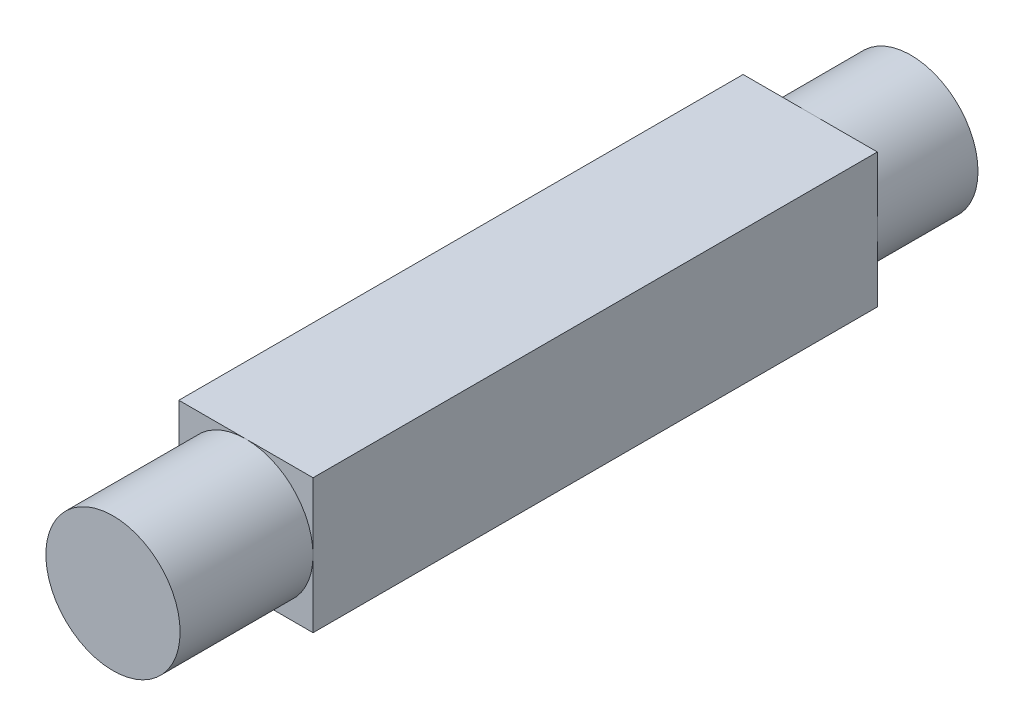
ISO-10303-21;
HEADER;
FILE_DESCRIPTION(('STEP AP214'),'2;1');
FILE_NAME('part.step','',(''),(''),'','','');
FILE_SCHEMA(('AUTOMOTIVE_DESIGN { 1 0 10303 214 1 1 1 1 }'));
ENDSEC;
DATA;
#1=APPLICATION_CONTEXT('core data for automotive mechanical design processes');
#2=APPLICATION_PROTOCOL_DEFINITION('international standard','automotive_design',2000,#1);
#3=PRODUCT_CONTEXT('',#1,'mechanical');
#4=PRODUCT('Part','Part','',(#3));
#5=PRODUCT_RELATED_PRODUCT_CATEGORY('part','',(#4));
#6=PRODUCT_DEFINITION_FORMATION('','',#4);
#7=PRODUCT_DEFINITION_CONTEXT('part definition',#1,'design');
#8=PRODUCT_DEFINITION('design','',#6,#7);
#9=PRODUCT_DEFINITION_SHAPE('','',#8);
#10=(LENGTH_UNIT() NAMED_UNIT(*) SI_UNIT(.MILLI.,.METRE.));
#11=(NAMED_UNIT(*) PLANE_ANGLE_UNIT() SI_UNIT($,.RADIAN.));
#12=(NAMED_UNIT(*) SI_UNIT($,.STERADIAN.) SOLID_ANGLE_UNIT());
#13=UNCERTAINTY_MEASURE_WITH_UNIT(LENGTH_MEASURE(1.E-05),#10,'distance_accuracy_value','');
#14=(GEOMETRIC_REPRESENTATION_CONTEXT(3) GLOBAL_UNCERTAINTY_ASSIGNED_CONTEXT((#13)) GLOBAL_UNIT_ASSIGNED_CONTEXT((#10,
#11,#12)) REPRESENTATION_CONTEXT('',''));
#15=CARTESIAN_POINT('',(0.,0.,0.));
#16=DIRECTION('',(0.,0.,1.));
#17=DIRECTION('',(1.,0.,0.));
#18=AXIS2_PLACEMENT_3D('',#15,#16,#17);
#19=CARTESIAN_POINT('',(0.,0.,84.5566));
#20=DIRECTION('',(0.,0.,-1.));
#21=DIRECTION('',(-1.,0.,0.));
#22=AXIS2_PLACEMENT_3D('',#19,#20,#21);
#23=CYLINDRICAL_SURFACE('',#22,4.7625);
#24=CARTESIAN_POINT('',(0.,0.,47.182786));
#25=DIRECTION('',(0.,0.,1.));
#26=DIRECTION('',(1.,0.,0.));
#27=AXIS2_PLACEMENT_3D('',#24,#25,#26);
#28=CIRCLE('',#27,4.7625);
#29=CARTESIAN_POINT('',(-4.7625,0.,47.182786));
#30=VERTEX_POINT('',#29);
#31=CARTESIAN_POINT('',(0.,-4.7625,47.182786));
#32=VERTEX_POINT('',#31);
#33=EDGE_CURVE('E125',#30,#32,#28,.T.);
#34=ORIENTED_EDGE('',*,*,#33,.T.);
#35=CARTESIAN_POINT('',(4.7625,0.,47.182786));
#36=VERTEX_POINT('',#35);
#37=EDGE_CURVE('E111',#32,#36,#28,.T.);
#38=ORIENTED_EDGE('',*,*,#37,.T.);
#39=CARTESIAN_POINT('',(0.,4.7625,47.182786));
#40=VERTEX_POINT('',#39);
#41=EDGE_CURVE('E123',#36,#40,#28,.T.);
#42=ORIENTED_EDGE('',*,*,#41,.T.);
#43=EDGE_CURVE('E133',#40,#30,#28,.T.);
#44=ORIENTED_EDGE('',*,*,#43,.T.);
#45=EDGE_LOOP('',(#34,#38,#42,#44));
#46=FACE_BOUND('',#45,.T.);
#47=CARTESIAN_POINT('',(0.,0.,56.6166));
#48=DIRECTION('',(0.,0.,1.));
#49=DIRECTION('',(1.,0.,0.));
#50=AXIS2_PLACEMENT_3D('',#47,#48,#49);
#51=CIRCLE('',#50,4.7625);
#52=CARTESIAN_POINT('',(4.7625,0.,56.6166));
#53=VERTEX_POINT('',#52);
#54=EDGE_CURVE('E126',#53,#53,#51,.T.);
#55=ORIENTED_EDGE('',*,*,#54,.F.);
#56=EDGE_LOOP('',(#55));
#57=FACE_BOUND('',#56,.T.);
#58=ADVANCED_FACE('F40',(#46,#57),#23,.T.);
#59=CARTESIAN_POINT('',(4.7625,4.7625,84.5566));
#60=DIRECTION('',(-1.,0.,0.));
#61=DIRECTION('',(0.,-1.,0.));
#62=AXIS2_PLACEMENT_3D('',#59,#60,#61);
#63=PLANE('',#62);
#64=DIRECTION('',(0.,0.,-1.));
#65=VECTOR('',#64,1.);
#66=CARTESIAN_POINT('',(4.7625,4.7625,84.5566));
#67=LINE('',#66,#65);
#68=CARTESIAN_POINT('',(4.7625,4.7625,47.182786));
#69=VERTEX_POINT('',#68);
#70=CARTESIAN_POINT('',(4.7625,4.7625,7.14247999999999));
#71=VERTEX_POINT('',#70);
#72=EDGE_CURVE('E136',#69,#71,#67,.T.);
#73=ORIENTED_EDGE('',*,*,#72,.F.);
#74=DIRECTION('',(0.,-1.,0.));
#75=VECTOR('',#74,1.);
#76=CARTESIAN_POINT('',(4.7625,4.7625,47.182786));
#77=LINE('',#76,#75);
#78=EDGE_CURVE('E116',#69,#36,#77,.T.);
#79=ORIENTED_EDGE('',*,*,#78,.T.);
#80=CARTESIAN_POINT('',(4.7625,-4.7625,47.182786));
#81=VERTEX_POINT('',#80);
#82=EDGE_CURVE('E108',#36,#81,#77,.T.);
#83=ORIENTED_EDGE('',*,*,#82,.T.);
#84=DIRECTION('',(0.,0.,-1.));
#85=VECTOR('',#84,1.);
#86=CARTESIAN_POINT('',(4.7625,-4.7625,84.5566));
#87=LINE('',#86,#85);
#88=CARTESIAN_POINT('',(4.7625,-4.7625,7.14247999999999));
#89=VERTEX_POINT('',#88);
#90=EDGE_CURVE('E159',#81,#89,#87,.T.);
#91=ORIENTED_EDGE('',*,*,#90,.T.);
#92=DIRECTION('',(0.,-1.,0.));
#93=VECTOR('',#92,1.);
#94=CARTESIAN_POINT('',(4.7625,4.7625,7.14247999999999));
#95=LINE('',#94,#93);
#96=CARTESIAN_POINT('',(4.7625,0.,7.14248));
#97=VERTEX_POINT('',#96);
#98=EDGE_CURVE('E150',#97,#89,#95,.T.);
#99=ORIENTED_EDGE('',*,*,#98,.F.);
#100=EDGE_CURVE('E154',#71,#97,#95,.T.);
#101=ORIENTED_EDGE('',*,*,#100,.F.);
#102=EDGE_LOOP('',(#73,#79,#83,#91,#99,#101));
#103=FACE_BOUND('',#102,.T.);
#104=ADVANCED_FACE('F42',(#103),#63,.F.);
#105=CARTESIAN_POINT('',(-4.7625,4.7625,84.5566));
#106=DIRECTION('',(0.,-1.,0.));
#107=DIRECTION('',(0.,0.,-1.));
#108=AXIS2_PLACEMENT_3D('',#105,#106,#107);
#109=PLANE('',#108);
#110=DIRECTION('',(0.,0.,-1.));
#111=VECTOR('',#110,1.);
#112=CARTESIAN_POINT('',(-4.7625,4.7625,84.5566));
#113=LINE('',#112,#111);
#114=CARTESIAN_POINT('',(-4.7625,4.7625,47.182786));
#115=VERTEX_POINT('',#114);
#116=CARTESIAN_POINT('',(-4.7625,4.7625,7.14247999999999));
#117=VERTEX_POINT('',#116);
#118=EDGE_CURVE('E163',#115,#117,#113,.T.);
#119=ORIENTED_EDGE('',*,*,#118,.F.);
#120=DIRECTION('',(1.,0.,0.));
#121=VECTOR('',#120,1.);
#122=CARTESIAN_POINT('',(-4.7625,4.7625,47.182786));
#123=LINE('',#122,#121);
#124=EDGE_CURVE('E142',#115,#40,#123,.T.);
#125=ORIENTED_EDGE('',*,*,#124,.T.);
#126=EDGE_CURVE('E131',#40,#69,#123,.T.);
#127=ORIENTED_EDGE('',*,*,#126,.T.);
#128=ORIENTED_EDGE('',*,*,#72,.T.);
#129=DIRECTION('',(1.,0.,0.));
#130=VECTOR('',#129,1.);
#131=CARTESIAN_POINT('',(-4.7625,4.7625,7.14247999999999));
#132=LINE('',#131,#130);
#133=CARTESIAN_POINT('',(0.,4.7625,7.14248));
#134=VERTEX_POINT('',#133);
#135=EDGE_CURVE('E155',#134,#71,#132,.T.);
#136=ORIENTED_EDGE('',*,*,#135,.F.);
#137=EDGE_CURVE('E158',#117,#134,#132,.T.);
#138=ORIENTED_EDGE('',*,*,#137,.F.);
#139=EDGE_LOOP('',(#119,#125,#127,#128,#136,#138));
#140=FACE_BOUND('',#139,.T.);
#141=ADVANCED_FACE('F210',(#140),#109,.F.);
#142=CARTESIAN_POINT('',(-4.7625,4.7625,84.5566));
#143=DIRECTION('',(1.,0.,0.));
#144=DIRECTION('',(0.,1.,0.));
#145=AXIS2_PLACEMENT_3D('',#142,#143,#144);
#146=PLANE('',#145);
#147=DIRECTION('',(0.,0.,-1.));
#148=VECTOR('',#147,1.);
#149=CARTESIAN_POINT('',(-4.7625,-4.7625,84.5566));
#150=LINE('',#149,#148);
#151=CARTESIAN_POINT('',(-4.7625,-4.7625,47.182786));
#152=VERTEX_POINT('',#151);
#153=CARTESIAN_POINT('',(-4.7625,-4.7625,7.14247999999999));
#154=VERTEX_POINT('',#153);
#155=EDGE_CURVE('E161',#152,#154,#150,.T.);
#156=ORIENTED_EDGE('',*,*,#155,.F.);
#157=DIRECTION('',(0.,1.,0.));
#158=VECTOR('',#157,1.);
#159=CARTESIAN_POINT('',(-4.7625,4.7625,47.182786));
#160=LINE('',#159,#158);
#161=EDGE_CURVE('E55',#152,#30,#160,.T.);
#162=ORIENTED_EDGE('',*,*,#161,.T.);
#163=EDGE_CURVE('E137',#30,#115,#160,.T.);
#164=ORIENTED_EDGE('',*,*,#163,.T.);
#165=ORIENTED_EDGE('',*,*,#118,.T.);
#166=DIRECTION('',(0.,1.,0.));
#167=VECTOR('',#166,1.);
#168=CARTESIAN_POINT('',(-4.7625,4.7625,7.14247999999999));
#169=LINE('',#168,#167);
#170=CARTESIAN_POINT('',(-4.7625,0.,7.14248));
#171=VERTEX_POINT('',#170);
#172=EDGE_CURVE('E151',#171,#117,#169,.T.);
#173=ORIENTED_EDGE('',*,*,#172,.F.);
#174=EDGE_CURVE('E146',#154,#171,#169,.T.);
#175=ORIENTED_EDGE('',*,*,#174,.F.);
#176=EDGE_LOOP('',(#156,#162,#164,#165,#173,#175));
#177=FACE_BOUND('',#176,.T.);
#178=ADVANCED_FACE('F181',(#177),#146,.F.);
#179=CARTESIAN_POINT('',(-4.7625,-4.7625,84.5566));
#180=DIRECTION('',(0.,1.,0.));
#181=DIRECTION('',(0.,0.,1.));
#182=AXIS2_PLACEMENT_3D('',#179,#180,#181);
#183=PLANE('',#182);
#184=ORIENTED_EDGE('',*,*,#90,.F.);
#185=DIRECTION('',(-1.,0.,0.));
#186=VECTOR('',#185,1.);
#187=CARTESIAN_POINT('',(-4.7625,-4.7625,47.182786));
#188=LINE('',#187,#186);
#189=EDGE_CURVE('E12',#81,#32,#188,.T.);
#190=ORIENTED_EDGE('',*,*,#189,.T.);
#191=EDGE_CURVE('E44',#32,#152,#188,.T.);
#192=ORIENTED_EDGE('',*,*,#191,.T.);
#193=ORIENTED_EDGE('',*,*,#155,.T.);
#194=DIRECTION('',(-1.,0.,0.));
#195=VECTOR('',#194,1.);
#196=CARTESIAN_POINT('',(-4.7625,-4.7625,7.14247999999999));
#197=LINE('',#196,#195);
#198=CARTESIAN_POINT('',(0.,-4.7625,7.14248));
#199=VERTEX_POINT('',#198);
#200=EDGE_CURVE('E168',#199,#154,#197,.T.);
#201=ORIENTED_EDGE('',*,*,#200,.F.);
#202=EDGE_CURVE('E170',#89,#199,#197,.T.);
#203=ORIENTED_EDGE('',*,*,#202,.F.);
#204=EDGE_LOOP('',(#184,#190,#192,#193,#201,#203));
#205=FACE_BOUND('',#204,.T.);
#206=ADVANCED_FACE('F179',(#205),#183,.F.);
#207=CARTESIAN_POINT('',(0.,0.,7.14248));
#208=DIRECTION('',(0.,0.,-1.));
#209=DIRECTION('',(-1.,0.,0.));
#210=AXIS2_PLACEMENT_3D('',#207,#208,#209);
#211=PLANE('',#210);
#212=ORIENTED_EDGE('',*,*,#137,.T.);
#213=CARTESIAN_POINT('',(0.,0.,7.14248));
#214=DIRECTION('',(0.,0.,-1.));
#215=DIRECTION('',(-1.,0.,0.));
#216=AXIS2_PLACEMENT_3D('',#213,#214,#215);
#217=CIRCLE('',#216,4.7625);
#218=EDGE_CURVE('E143',#171,#134,#217,.T.);
#219=ORIENTED_EDGE('',*,*,#218,.F.);
#220=ORIENTED_EDGE('',*,*,#172,.T.);
#221=EDGE_LOOP('',(#212,#219,#220));
#222=FACE_BOUND('',#221,.T.);
#223=ADVANCED_FACE('F189',(#222),#211,.T.);
#224=ORIENTED_EDGE('',*,*,#135,.T.);
#225=ORIENTED_EDGE('',*,*,#100,.T.);
#226=EDGE_CURVE('E147',#134,#97,#217,.T.);
#227=ORIENTED_EDGE('',*,*,#226,.F.);
#228=EDGE_LOOP('',(#224,#225,#227));
#229=FACE_BOUND('',#228,.T.);
#230=ADVANCED_FACE('F195',(#229),#211,.T.);
#231=ORIENTED_EDGE('',*,*,#98,.T.);
#232=ORIENTED_EDGE('',*,*,#202,.T.);
#233=EDGE_CURVE('E63',#97,#199,#217,.T.);
#234=ORIENTED_EDGE('',*,*,#233,.F.);
#235=EDGE_LOOP('',(#231,#232,#234));
#236=FACE_BOUND('',#235,.T.);
#237=ADVANCED_FACE('F197',(#236),#211,.T.);
#238=ORIENTED_EDGE('',*,*,#174,.T.);
#239=EDGE_CURVE('E148',#199,#171,#217,.T.);
#240=ORIENTED_EDGE('',*,*,#239,.F.);
#241=ORIENTED_EDGE('',*,*,#200,.T.);
#242=EDGE_LOOP('',(#238,#240,#241));
#243=FACE_BOUND('',#242,.T.);
#244=ADVANCED_FACE('F184',(#243),#211,.T.);
#245=CARTESIAN_POINT('',(0.,0.,7.14248));
#246=DIRECTION('',(0.,0.,-1.));
#247=DIRECTION('',(-1.,0.,0.));
#248=AXIS2_PLACEMENT_3D('',#245,#246,#247);
#249=CYLINDRICAL_SURFACE('',#248,4.7625);
#250=CARTESIAN_POINT('',(0.,0.,0.));
#251=DIRECTION('',(0.,0.,1.));
#252=DIRECTION('',(1.,0.,0.));
#253=AXIS2_PLACEMENT_3D('',#250,#251,#252);
#254=CIRCLE('',#253,4.7625);
#255=CARTESIAN_POINT('',(4.7625,0.,0.));
#256=VERTEX_POINT('',#255);
#257=EDGE_CURVE('E166',#256,#256,#254,.T.);
#258=ORIENTED_EDGE('',*,*,#257,.T.);
#259=EDGE_LOOP('',(#258));
#260=FACE_BOUND('',#259,.T.);
#261=ORIENTED_EDGE('',*,*,#226,.T.);
#262=ORIENTED_EDGE('',*,*,#233,.T.);
#263=ORIENTED_EDGE('',*,*,#239,.T.);
#264=ORIENTED_EDGE('',*,*,#218,.T.);
#265=EDGE_LOOP('',(#261,#262,#263,#264));
#266=FACE_BOUND('',#265,.T.);
#267=ADVANCED_FACE('F186',(#260,#266),#249,.T.);
#268=CARTESIAN_POINT('',(0.,0.,0.));
#269=DIRECTION('',(0.,0.,1.));
#270=DIRECTION('',(1.,0.,0.));
#271=AXIS2_PLACEMENT_3D('',#268,#269,#270);
#272=PLANE('',#271);
#273=ORIENTED_EDGE('',*,*,#257,.F.);
#274=EDGE_LOOP('',(#273));
#275=FACE_BOUND('',#274,.T.);
#276=ADVANCED_FACE('F212',(#275),#272,.F.);
#277=CARTESIAN_POINT('',(0.,0.,47.182786));
#278=DIRECTION('',(0.,0.,-1.));
#279=DIRECTION('',(-1.,0.,0.));
#280=AXIS2_PLACEMENT_3D('',#277,#278,#279);
#281=PLANE('',#280);
#282=ORIENTED_EDGE('',*,*,#163,.F.);
#283=ORIENTED_EDGE('',*,*,#43,.F.);
#284=ORIENTED_EDGE('',*,*,#124,.F.);
#285=EDGE_LOOP('',(#282,#283,#284));
#286=FACE_BOUND('',#285,.T.);
#287=ADVANCED_FACE('F215',(#286),#281,.F.);
#288=ORIENTED_EDGE('',*,*,#41,.F.);
#289=ORIENTED_EDGE('',*,*,#78,.F.);
#290=ORIENTED_EDGE('',*,*,#126,.F.);
#291=EDGE_LOOP('',(#288,#289,#290));
#292=FACE_BOUND('',#291,.T.);
#293=ADVANCED_FACE('F129',(#292),#281,.F.);
#294=ORIENTED_EDGE('',*,*,#37,.F.);
#295=ORIENTED_EDGE('',*,*,#189,.F.);
#296=ORIENTED_EDGE('',*,*,#82,.F.);
#297=EDGE_LOOP('',(#294,#295,#296));
#298=FACE_BOUND('',#297,.T.);
#299=ADVANCED_FACE('F110',(#298),#281,.F.);
#300=ORIENTED_EDGE('',*,*,#191,.F.);
#301=ORIENTED_EDGE('',*,*,#33,.F.);
#302=ORIENTED_EDGE('',*,*,#161,.F.);
#303=EDGE_LOOP('',(#300,#301,#302));
#304=FACE_BOUND('',#303,.T.);
#305=ADVANCED_FACE('F224',(#304),#281,.F.);
#306=CARTESIAN_POINT('',(0.,0.,56.6166));
#307=DIRECTION('',(0.,0.,1.));
#308=DIRECTION('',(1.,0.,0.));
#309=AXIS2_PLACEMENT_3D('',#306,#307,#308);
#310=PLANE('',#309);
#311=ORIENTED_EDGE('',*,*,#54,.T.);
#312=EDGE_LOOP('',(#311));
#313=FACE_BOUND('',#312,.T.);
#314=ADVANCED_FACE('F229',(#313),#310,.T.);
#315=CLOSED_SHELL('',(#58,#104,#141,#178,#206,#223,#230,#237,#244,#267,#276,#287,#293,#299,#305,#314));
#316=MANIFOLD_SOLID_BREP('B2',#315);
#317=ADVANCED_BREP_SHAPE_REPRESENTATION('',(#18,#316),#14);
#318=SHAPE_DEFINITION_REPRESENTATION(#9,#317);
ENDSEC;
END-ISO-10303-21;
